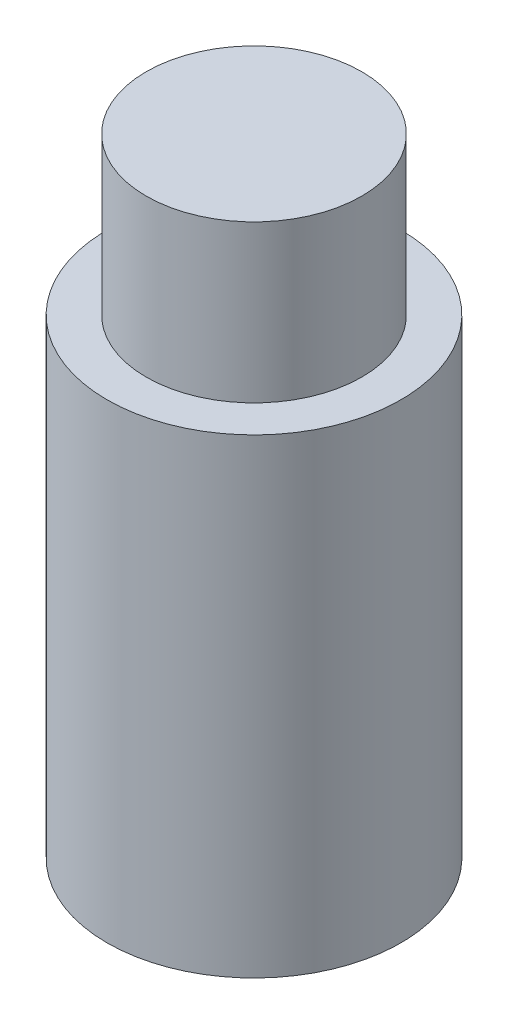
from build123d import *


with BuildPart() as part:
    # Sketch 1 → Revolve 1 (revolve)
    with BuildSketch(Plane(origin=(0, 0, 0), x_dir=(0, 0, -1), z_dir=(1, 0, 0))):
        Polygon((0, 16), (-2.75, 16), (-2.75, 12), (-3.75, 12), (-3.75, 0), (-1.75, 0), (-1.75, 3), (0, 3), align=None)
    revolve(axis=Axis((0, 16, 0), (0, -1, 0)))


solid = part.part
